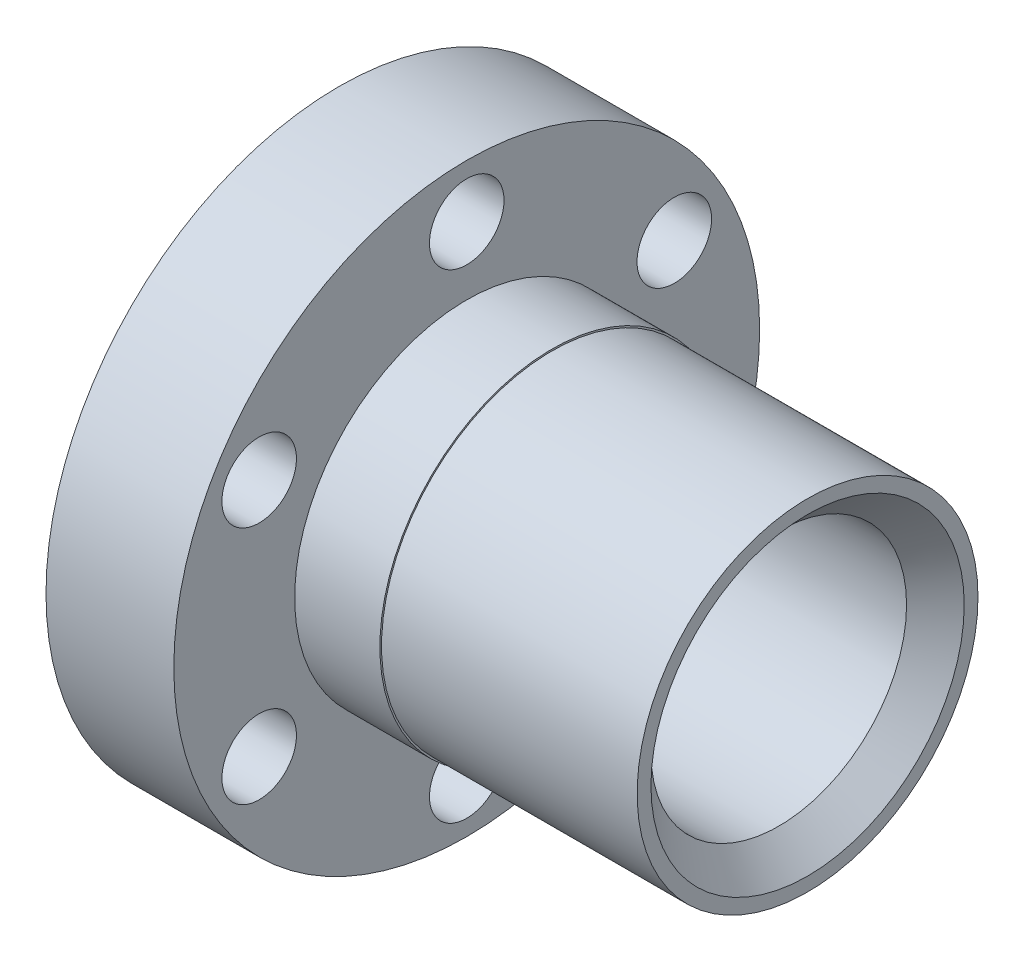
ISO-10303-21;
HEADER;
FILE_DESCRIPTION(('STEP AP214'),'2;1');
FILE_NAME('part.step','',(''),(''),'','','');
FILE_SCHEMA(('AUTOMOTIVE_DESIGN { 1 0 10303 214 1 1 1 1 }'));
ENDSEC;
DATA;
#1=APPLICATION_CONTEXT('core data for automotive mechanical design processes');
#2=APPLICATION_PROTOCOL_DEFINITION('international standard','automotive_design',2000,#1);
#3=PRODUCT_CONTEXT('',#1,'mechanical');
#4=PRODUCT('Part','Part','',(#3));
#5=PRODUCT_RELATED_PRODUCT_CATEGORY('part','',(#4));
#6=PRODUCT_DEFINITION_FORMATION('','',#4);
#7=PRODUCT_DEFINITION_CONTEXT('part definition',#1,'design');
#8=PRODUCT_DEFINITION('design','',#6,#7);
#9=PRODUCT_DEFINITION_SHAPE('','',#8);
#10=(LENGTH_UNIT() NAMED_UNIT(*) SI_UNIT(.MILLI.,.METRE.));
#11=(NAMED_UNIT(*) PLANE_ANGLE_UNIT() SI_UNIT($,.RADIAN.));
#12=(NAMED_UNIT(*) SI_UNIT($,.STERADIAN.) SOLID_ANGLE_UNIT());
#13=UNCERTAINTY_MEASURE_WITH_UNIT(LENGTH_MEASURE(1.E-05),#10,'distance_accuracy_value','');
#14=(GEOMETRIC_REPRESENTATION_CONTEXT(3) GLOBAL_UNCERTAINTY_ASSIGNED_CONTEXT((#13)) GLOBAL_UNIT_ASSIGNED_CONTEXT((#10,
#11,#12)) REPRESENTATION_CONTEXT('',''));
#15=CARTESIAN_POINT('',(0.,0.,0.));
#16=DIRECTION('',(0.,0.,1.));
#17=DIRECTION('',(1.,0.,0.));
#18=AXIS2_PLACEMENT_3D('',#15,#16,#17);
#19=CARTESIAN_POINT('',(32.,0.,0.));
#20=DIRECTION('',(1.,0.,0.));
#21=DIRECTION('',(0.,0.,-1.));
#22=AXIS2_PLACEMENT_3D('',#19,#20,#21);
#23=CYLINDRICAL_SURFACE('',#22,16.);
#24=CARTESIAN_POINT('',(44.,0.,0.));
#25=DIRECTION('',(1.,0.,0.));
#26=DIRECTION('',(0.,0.,-1.));
#27=AXIS2_PLACEMENT_3D('',#24,#25,#26);
#28=CIRCLE('',#27,16.);
#29=CARTESIAN_POINT('',(44.,0.,-16.));
#30=VERTEX_POINT('',#29);
#31=EDGE_CURVE('E80',#30,#30,#28,.T.);
#32=ORIENTED_EDGE('',*,*,#31,.F.);
#33=EDGE_LOOP('',(#32));
#34=FACE_BOUND('',#33,.T.);
#35=CARTESIAN_POINT('',(20.,0.,0.));
#36=DIRECTION('',(1.,0.,0.));
#37=DIRECTION('',(0.,0.,-1.));
#38=AXIS2_PLACEMENT_3D('',#35,#36,#37);
#39=CIRCLE('',#38,16.);
#40=CARTESIAN_POINT('',(20.,0.,-16.));
#41=VERTEX_POINT('',#40);
#42=EDGE_CURVE('E18',#41,#41,#39,.F.);
#43=ORIENTED_EDGE('',*,*,#42,.F.);
#44=EDGE_LOOP('',(#43));
#45=FACE_BOUND('',#44,.T.);
#46=ADVANCED_FACE('F14',(#34,#45),#23,.T.);
#47=CARTESIAN_POINT('',(20.,16.0775,0.));
#48=DIRECTION('',(1.,0.,0.));
#49=DIRECTION('',(0.,0.,-1.));
#50=AXIS2_PLACEMENT_3D('',#47,#48,#49);
#51=PLANE('',#50);
#52=ORIENTED_EDGE('',*,*,#42,.T.);
#53=EDGE_LOOP('',(#52));
#54=FACE_BOUND('',#53,.T.);
#55=CARTESIAN_POINT('',(20.,0.,0.));
#56=DIRECTION('',(1.,0.,0.));
#57=DIRECTION('',(0.,0.,-1.));
#58=AXIS2_PLACEMENT_3D('',#55,#56,#57);
#59=CIRCLE('',#58,16.155);
#60=CARTESIAN_POINT('',(20.,0.,-16.155));
#61=VERTEX_POINT('',#60);
#62=EDGE_CURVE('E78',#61,#61,#59,.F.);
#63=ORIENTED_EDGE('',*,*,#62,.F.);
#64=EDGE_LOOP('',(#63));
#65=FACE_BOUND('',#64,.T.);
#66=ADVANCED_FACE('F87',(#54,#65),#51,.T.);
#67=CARTESIAN_POINT('',(44.,15.353125,0.));
#68=DIRECTION('',(1.,0.,0.));
#69=DIRECTION('',(0.,0.,-1.));
#70=AXIS2_PLACEMENT_3D('',#67,#68,#69);
#71=PLANE('',#70);
#72=CARTESIAN_POINT('',(44.0000000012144,0.,0.));
#73=DIRECTION('',(1.,0.,0.));
#74=DIRECTION('',(0.,0.,-1.));
#75=AXIS2_PLACEMENT_3D('',#72,#73,#74);
#76=CIRCLE('',#75,14.7062499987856);
#77=CARTESIAN_POINT('',(44.0000000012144,0.,-14.7062499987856));
#78=VERTEX_POINT('',#77);
#79=EDGE_CURVE('E75',#78,#78,#76,.F.);
#80=ORIENTED_EDGE('',*,*,#79,.T.);
#81=EDGE_LOOP('',(#80));
#82=FACE_BOUND('',#81,.T.);
#83=ORIENTED_EDGE('',*,*,#31,.T.);
#84=EDGE_LOOP('',(#83));
#85=FACE_BOUND('',#84,.T.);
#86=ADVANCED_FACE('F96',(#82,#85),#71,.T.);
#87=CARTESIAN_POINT('',(16.,0.,0.));
#88=DIRECTION('',(1.,0.,0.));
#89=DIRECTION('',(0.,0.,-1.));
#90=AXIS2_PLACEMENT_3D('',#87,#88,#89);
#91=CYLINDRICAL_SURFACE('',#90,16.155);
#92=ORIENTED_EDGE('',*,*,#62,.T.);
#93=EDGE_LOOP('',(#92));
#94=FACE_BOUND('',#93,.T.);
#95=CARTESIAN_POINT('',(12.,0.,0.));
#96=DIRECTION('',(1.,0.,0.));
#97=DIRECTION('',(0.,0.,-1.));
#98=AXIS2_PLACEMENT_3D('',#95,#96,#97);
#99=CIRCLE('',#98,16.155);
#100=CARTESIAN_POINT('',(12.,0.,-16.155));
#101=VERTEX_POINT('',#100);
#102=EDGE_CURVE('E72',#101,#101,#99,.F.);
#103=ORIENTED_EDGE('',*,*,#102,.F.);
#104=EDGE_LOOP('',(#103));
#105=FACE_BOUND('',#104,.T.);
#106=ADVANCED_FACE('F179',(#94,#105),#91,.T.);
#107=CARTESIAN_POINT('',(44.0000000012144,0.,0.));
#108=DIRECTION('',(1.,0.,0.));
#109=DIRECTION('',(0.,0.,-1.));
#110=AXIS2_PLACEMENT_3D('',#107,#108,#109);
#111=CONICAL_SURFACE('',#110,14.7062499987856,0.7853981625);
#112=CARTESIAN_POINT('',(41.29375,0.,0.));
#113=DIRECTION('',(1.,0.,0.));
#114=DIRECTION('',(0.,0.,-1.));
#115=AXIS2_PLACEMENT_3D('',#112,#113,#114);
#116=CIRCLE('',#115,12.);
#117=CARTESIAN_POINT('',(41.29375,0.,-12.));
#118=VERTEX_POINT('',#117);
#119=EDGE_CURVE('E30',#118,#118,#116,.F.);
#120=ORIENTED_EDGE('',*,*,#119,.T.);
#121=EDGE_LOOP('',(#120));
#122=FACE_BOUND('',#121,.T.);
#123=ORIENTED_EDGE('',*,*,#79,.F.);
#124=EDGE_LOOP('',(#123));
#125=FACE_BOUND('',#124,.T.);
#126=ADVANCED_FACE('F159',(#122,#125),#111,.F.);
#127=CARTESIAN_POINT('',(12.,21.8275,0.));
#128=DIRECTION('',(1.,0.,0.));
#129=DIRECTION('',(0.,0.,-1.));
#130=AXIS2_PLACEMENT_3D('',#127,#128,#129);
#131=PLANE('',#130);
#132=ORIENTED_EDGE('',*,*,#102,.T.);
#133=EDGE_LOOP('',(#132));
#134=FACE_BOUND('',#133,.T.);
#135=CARTESIAN_POINT('',(12.,22.5,0.));
#136=DIRECTION('',(1.,0.,0.));
#137=DIRECTION('',(0.,0.,-1.));
#138=AXIS2_PLACEMENT_3D('',#135,#136,#137);
#139=CIRCLE('',#138,3.5);
#140=CARTESIAN_POINT('',(12.,22.5,-3.5));
#141=VERTEX_POINT('',#140);
#142=EDGE_CURVE('E51',#141,#141,#139,.F.);
#143=ORIENTED_EDGE('',*,*,#142,.T.);
#144=EDGE_LOOP('',(#143));
#145=FACE_BOUND('',#144,.T.);
#146=CARTESIAN_POINT('',(12.,11.25,19.4855715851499));
#147=DIRECTION('',(1.,0.,0.));
#148=DIRECTION('',(0.,0.,-1.));
#149=AXIS2_PLACEMENT_3D('',#146,#147,#148);
#150=CIRCLE('',#149,3.5);
#151=CARTESIAN_POINT('',(12.,11.25,15.9855715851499));
#152=VERTEX_POINT('',#151);
#153=EDGE_CURVE('E54',#152,#152,#150,.F.);
#154=ORIENTED_EDGE('',*,*,#153,.T.);
#155=EDGE_LOOP('',(#154));
#156=FACE_BOUND('',#155,.T.);
#157=CARTESIAN_POINT('',(12.,-11.25,19.4855715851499));
#158=DIRECTION('',(1.,0.,0.));
#159=DIRECTION('',(0.,0.,-1.));
#160=AXIS2_PLACEMENT_3D('',#157,#158,#159);
#161=CIRCLE('',#160,3.5);
#162=CARTESIAN_POINT('',(12.,-11.25,15.9855715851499));
#163=VERTEX_POINT('',#162);
#164=EDGE_CURVE('E57',#163,#163,#161,.F.);
#165=ORIENTED_EDGE('',*,*,#164,.T.);
#166=EDGE_LOOP('',(#165));
#167=FACE_BOUND('',#166,.T.);
#168=CARTESIAN_POINT('',(12.,-22.5,0.));
#169=DIRECTION('',(1.,0.,0.));
#170=DIRECTION('',(0.,0.,-1.));
#171=AXIS2_PLACEMENT_3D('',#168,#169,#170);
#172=CIRCLE('',#171,3.5);
#173=CARTESIAN_POINT('',(12.,-22.5,-3.5));
#174=VERTEX_POINT('',#173);
#175=EDGE_CURVE('E60',#174,#174,#172,.F.);
#176=ORIENTED_EDGE('',*,*,#175,.T.);
#177=EDGE_LOOP('',(#176));
#178=FACE_BOUND('',#177,.T.);
#179=CARTESIAN_POINT('',(12.,-11.25,-19.4855715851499));
#180=DIRECTION('',(1.,0.,0.));
#181=DIRECTION('',(0.,0.,-1.));
#182=AXIS2_PLACEMENT_3D('',#179,#180,#181);
#183=CIRCLE('',#182,3.5);
#184=CARTESIAN_POINT('',(12.,-11.25,-22.9855715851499));
#185=VERTEX_POINT('',#184);
#186=EDGE_CURVE('E63',#185,#185,#183,.F.);
#187=ORIENTED_EDGE('',*,*,#186,.T.);
#188=EDGE_LOOP('',(#187));
#189=FACE_BOUND('',#188,.T.);
#190=CARTESIAN_POINT('',(12.,11.25,-19.4855715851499));
#191=DIRECTION('',(1.,0.,0.));
#192=DIRECTION('',(0.,0.,-1.));
#193=AXIS2_PLACEMENT_3D('',#190,#191,#192);
#194=CIRCLE('',#193,3.5);
#195=CARTESIAN_POINT('',(12.,11.25,-22.9855715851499));
#196=VERTEX_POINT('',#195);
#197=EDGE_CURVE('E66',#196,#196,#194,.F.);
#198=ORIENTED_EDGE('',*,*,#197,.T.);
#199=EDGE_LOOP('',(#198));
#200=FACE_BOUND('',#199,.T.);
#201=CARTESIAN_POINT('',(12.,0.,0.));
#202=DIRECTION('',(1.,0.,0.));
#203=DIRECTION('',(0.,0.,-1.));
#204=AXIS2_PLACEMENT_3D('',#201,#202,#203);
#205=CIRCLE('',#204,27.5);
#206=CARTESIAN_POINT('',(12.,0.,-27.5));
#207=VERTEX_POINT('',#206);
#208=EDGE_CURVE('E69',#207,#207,#205,.F.);
#209=ORIENTED_EDGE('',*,*,#208,.F.);
#210=EDGE_LOOP('',(#209));
#211=FACE_BOUND('',#210,.T.);
#212=ADVANCED_FACE('F131',(#134,#145,#156,#167,#178,#189,#200,#211),#131,.T.);
#213=CARTESIAN_POINT('',(22.,0.,0.));
#214=DIRECTION('',(1.,0.,0.));
#215=DIRECTION('',(0.,0.,-1.));
#216=AXIS2_PLACEMENT_3D('',#213,#214,#215);
#217=CYLINDRICAL_SURFACE('',#216,12.);
#218=CARTESIAN_POINT('',(2.70625000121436,0.,0.));
#219=DIRECTION('',(-1.,0.,0.));
#220=DIRECTION('',(0.,1.,0.));
#221=AXIS2_PLACEMENT_3D('',#218,#219,#220);
#222=CIRCLE('',#221,12.0000000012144);
#223=CARTESIAN_POINT('',(2.70625000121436,12.0000000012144,0.));
#224=VERTEX_POINT('',#223);
#225=EDGE_CURVE('E50',#224,#224,#222,.T.);
#226=ORIENTED_EDGE('',*,*,#225,.T.);
#227=EDGE_LOOP('',(#226));
#228=FACE_BOUND('',#227,.T.);
#229=ORIENTED_EDGE('',*,*,#119,.F.);
#230=EDGE_LOOP('',(#229));
#231=FACE_BOUND('',#230,.T.);
#232=ADVANCED_FACE('F122',(#228,#231),#217,.F.);
#233=CARTESIAN_POINT('',(6.,0.,0.));
#234=DIRECTION('',(1.,0.,0.));
#235=DIRECTION('',(0.,0.,-1.));
#236=AXIS2_PLACEMENT_3D('',#233,#234,#235);
#237=CYLINDRICAL_SURFACE('',#236,27.5);
#238=ORIENTED_EDGE('',*,*,#208,.T.);
#239=EDGE_LOOP('',(#238));
#240=FACE_BOUND('',#239,.T.);
#241=CARTESIAN_POINT('',(0.,0.,0.));
#242=DIRECTION('',(1.,0.,0.));
#243=DIRECTION('',(0.,0.,-1.));
#244=AXIS2_PLACEMENT_3D('',#241,#242,#243);
#245=CIRCLE('',#244,27.5);
#246=CARTESIAN_POINT('',(0.,0.,-27.5));
#247=VERTEX_POINT('',#246);
#248=EDGE_CURVE('E47',#247,#247,#245,.F.);
#249=ORIENTED_EDGE('',*,*,#248,.F.);
#250=EDGE_LOOP('',(#249));
#251=FACE_BOUND('',#250,.T.);
#252=ADVANCED_FACE('F119',(#240,#251),#237,.T.);
#253=CARTESIAN_POINT('',(17.,11.25,-19.4855715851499));
#254=DIRECTION('',(1.,0.,0.));
#255=DIRECTION('',(0.,0.,-1.));
#256=AXIS2_PLACEMENT_3D('',#253,#254,#255);
#257=CYLINDRICAL_SURFACE('',#256,3.5);
#258=ORIENTED_EDGE('',*,*,#197,.F.);
#259=EDGE_LOOP('',(#258));
#260=FACE_BOUND('',#259,.T.);
#261=CARTESIAN_POINT('',(0.,11.25,-19.4855715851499));
#262=DIRECTION('',(1.,0.,0.));
#263=DIRECTION('',(0.,0.,-1.));
#264=AXIS2_PLACEMENT_3D('',#261,#262,#263);
#265=CIRCLE('',#264,3.5);
#266=CARTESIAN_POINT('',(0.,11.25,-22.9855715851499));
#267=VERTEX_POINT('',#266);
#268=EDGE_CURVE('E44',#267,#267,#265,.T.);
#269=ORIENTED_EDGE('',*,*,#268,.F.);
#270=EDGE_LOOP('',(#269));
#271=FACE_BOUND('',#270,.T.);
#272=ADVANCED_FACE('F121',(#260,#271),#257,.F.);
#273=CARTESIAN_POINT('',(17.,-11.25,-19.4855715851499));
#274=DIRECTION('',(1.,0.,0.));
#275=DIRECTION('',(0.,0.,-1.));
#276=AXIS2_PLACEMENT_3D('',#273,#274,#275);
#277=CYLINDRICAL_SURFACE('',#276,3.5);
#278=ORIENTED_EDGE('',*,*,#186,.F.);
#279=EDGE_LOOP('',(#278));
#280=FACE_BOUND('',#279,.T.);
#281=CARTESIAN_POINT('',(0.,-11.25,-19.4855715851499));
#282=DIRECTION('',(1.,0.,0.));
#283=DIRECTION('',(0.,0.,-1.));
#284=AXIS2_PLACEMENT_3D('',#281,#282,#283);
#285=CIRCLE('',#284,3.5);
#286=CARTESIAN_POINT('',(0.,-11.25,-22.9855715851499));
#287=VERTEX_POINT('',#286);
#288=EDGE_CURVE('E41',#287,#287,#285,.T.);
#289=ORIENTED_EDGE('',*,*,#288,.F.);
#290=EDGE_LOOP('',(#289));
#291=FACE_BOUND('',#290,.T.);
#292=ADVANCED_FACE('F127',(#280,#291),#277,.F.);
#293=CARTESIAN_POINT('',(17.,-22.5,0.));
#294=DIRECTION('',(1.,0.,0.));
#295=DIRECTION('',(0.,0.,-1.));
#296=AXIS2_PLACEMENT_3D('',#293,#294,#295);
#297=CYLINDRICAL_SURFACE('',#296,3.5);
#298=ORIENTED_EDGE('',*,*,#175,.F.);
#299=EDGE_LOOP('',(#298));
#300=FACE_BOUND('',#299,.T.);
#301=CARTESIAN_POINT('',(0.,-22.5,0.));
#302=DIRECTION('',(1.,0.,0.));
#303=DIRECTION('',(0.,0.,-1.));
#304=AXIS2_PLACEMENT_3D('',#301,#302,#303);
#305=CIRCLE('',#304,3.5);
#306=CARTESIAN_POINT('',(0.,-22.5,-3.5));
#307=VERTEX_POINT('',#306);
#308=EDGE_CURVE('E38',#307,#307,#305,.T.);
#309=ORIENTED_EDGE('',*,*,#308,.F.);
#310=EDGE_LOOP('',(#309));
#311=FACE_BOUND('',#310,.T.);
#312=ADVANCED_FACE('F138',(#300,#311),#297,.F.);
#313=CARTESIAN_POINT('',(17.,-11.25,19.4855715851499));
#314=DIRECTION('',(1.,0.,0.));
#315=DIRECTION('',(0.,0.,-1.));
#316=AXIS2_PLACEMENT_3D('',#313,#314,#315);
#317=CYLINDRICAL_SURFACE('',#316,3.5);
#318=ORIENTED_EDGE('',*,*,#164,.F.);
#319=EDGE_LOOP('',(#318));
#320=FACE_BOUND('',#319,.T.);
#321=CARTESIAN_POINT('',(0.,-11.25,19.4855715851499));
#322=DIRECTION('',(1.,0.,0.));
#323=DIRECTION('',(0.,0.,-1.));
#324=AXIS2_PLACEMENT_3D('',#321,#322,#323);
#325=CIRCLE('',#324,3.5);
#326=CARTESIAN_POINT('',(0.,-11.25,15.9855715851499));
#327=VERTEX_POINT('',#326);
#328=EDGE_CURVE('E35',#327,#327,#325,.T.);
#329=ORIENTED_EDGE('',*,*,#328,.F.);
#330=EDGE_LOOP('',(#329));
#331=FACE_BOUND('',#330,.T.);
#332=ADVANCED_FACE('F142',(#320,#331),#317,.F.);
#333=CARTESIAN_POINT('',(17.,11.25,19.4855715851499));
#334=DIRECTION('',(1.,0.,0.));
#335=DIRECTION('',(0.,0.,-1.));
#336=AXIS2_PLACEMENT_3D('',#333,#334,#335);
#337=CYLINDRICAL_SURFACE('',#336,3.5);
#338=ORIENTED_EDGE('',*,*,#153,.F.);
#339=EDGE_LOOP('',(#338));
#340=FACE_BOUND('',#339,.T.);
#341=CARTESIAN_POINT('',(0.,11.25,19.4855715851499));
#342=DIRECTION('',(1.,0.,0.));
#343=DIRECTION('',(0.,0.,-1.));
#344=AXIS2_PLACEMENT_3D('',#341,#342,#343);
#345=CIRCLE('',#344,3.5);
#346=CARTESIAN_POINT('',(0.,11.25,15.9855715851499));
#347=VERTEX_POINT('',#346);
#348=EDGE_CURVE('E27',#347,#347,#345,.T.);
#349=ORIENTED_EDGE('',*,*,#348,.F.);
#350=EDGE_LOOP('',(#349));
#351=FACE_BOUND('',#350,.T.);
#352=ADVANCED_FACE('F146',(#340,#351),#337,.F.);
#353=CARTESIAN_POINT('',(17.,22.5,0.));
#354=DIRECTION('',(1.,0.,0.));
#355=DIRECTION('',(0.,0.,-1.));
#356=AXIS2_PLACEMENT_3D('',#353,#354,#355);
#357=CYLINDRICAL_SURFACE('',#356,3.5);
#358=ORIENTED_EDGE('',*,*,#142,.F.);
#359=EDGE_LOOP('',(#358));
#360=FACE_BOUND('',#359,.T.);
#361=CARTESIAN_POINT('',(0.,22.5,0.));
#362=DIRECTION('',(1.,0.,0.));
#363=DIRECTION('',(0.,0.,-1.));
#364=AXIS2_PLACEMENT_3D('',#361,#362,#363);
#365=CIRCLE('',#364,3.5);
#366=CARTESIAN_POINT('',(0.,22.5,-3.5));
#367=VERTEX_POINT('',#366);
#368=EDGE_CURVE('E22',#367,#367,#365,.T.);
#369=ORIENTED_EDGE('',*,*,#368,.F.);
#370=EDGE_LOOP('',(#369));
#371=FACE_BOUND('',#370,.T.);
#372=ADVANCED_FACE('F102',(#360,#371),#357,.F.);
#373=CARTESIAN_POINT('',(-1.21435955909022E-09,0.,0.));
#374=DIRECTION('',(-1.,0.,0.));
#375=DIRECTION('',(0.,0.,1.));
#376=AXIS2_PLACEMENT_3D('',#373,#374,#375);
#377=CONICAL_SURFACE('',#376,14.7062499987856,0.7853981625);
#378=CARTESIAN_POINT('',(-1.21436020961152E-09,0.,0.));
#379=DIRECTION('',(-1.,0.,0.));
#380=DIRECTION('',(0.,0.,1.));
#381=AXIS2_PLACEMENT_3D('',#378,#379,#380);
#382=CIRCLE('',#381,14.7062499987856);
#383=CARTESIAN_POINT('',(-1.21436020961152E-09,0.,14.7062499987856));
#384=VERTEX_POINT('',#383);
#385=EDGE_CURVE('E9',#384,#384,#382,.F.);
#386=ORIENTED_EDGE('',*,*,#385,.F.);
#387=EDGE_LOOP('',(#386));
#388=FACE_BOUND('',#387,.T.);
#389=ORIENTED_EDGE('',*,*,#225,.F.);
#390=EDGE_LOOP('',(#389));
#391=FACE_BOUND('',#390,.T.);
#392=ADVANCED_FACE('F99',(#388,#391),#377,.F.);
#393=CARTESIAN_POINT('',(0.,21.103125,0.));
#394=DIRECTION('',(-1.,0.,0.));
#395=DIRECTION('',(0.,0.,1.));
#396=AXIS2_PLACEMENT_3D('',#393,#394,#395);
#397=PLANE('',#396);
#398=ORIENTED_EDGE('',*,*,#385,.T.);
#399=EDGE_LOOP('',(#398));
#400=FACE_BOUND('',#399,.T.);
#401=ORIENTED_EDGE('',*,*,#368,.T.);
#402=EDGE_LOOP('',(#401));
#403=FACE_BOUND('',#402,.T.);
#404=ORIENTED_EDGE('',*,*,#348,.T.);
#405=EDGE_LOOP('',(#404));
#406=FACE_BOUND('',#405,.T.);
#407=ORIENTED_EDGE('',*,*,#328,.T.);
#408=EDGE_LOOP('',(#407));
#409=FACE_BOUND('',#408,.T.);
#410=ORIENTED_EDGE('',*,*,#308,.T.);
#411=EDGE_LOOP('',(#410));
#412=FACE_BOUND('',#411,.T.);
#413=ORIENTED_EDGE('',*,*,#288,.T.);
#414=EDGE_LOOP('',(#413));
#415=FACE_BOUND('',#414,.T.);
#416=ORIENTED_EDGE('',*,*,#268,.T.);
#417=EDGE_LOOP('',(#416));
#418=FACE_BOUND('',#417,.T.);
#419=ORIENTED_EDGE('',*,*,#248,.T.);
#420=EDGE_LOOP('',(#419));
#421=FACE_BOUND('',#420,.T.);
#422=ADVANCED_FACE('F16',(#400,#403,#406,#409,#412,#415,#418,#421),#397,.T.);
#423=CLOSED_SHELL('',(#46,#66,#86,#106,#126,#212,#232,#252,#272,#292,#312,#332,#352,#372,#392,#422));
#424=MANIFOLD_SOLID_BREP('B1',#423);
#425=ADVANCED_BREP_SHAPE_REPRESENTATION('',(#18,#424),#14);
#426=SHAPE_DEFINITION_REPRESENTATION(#9,#425);
ENDSEC;
END-ISO-10303-21;
